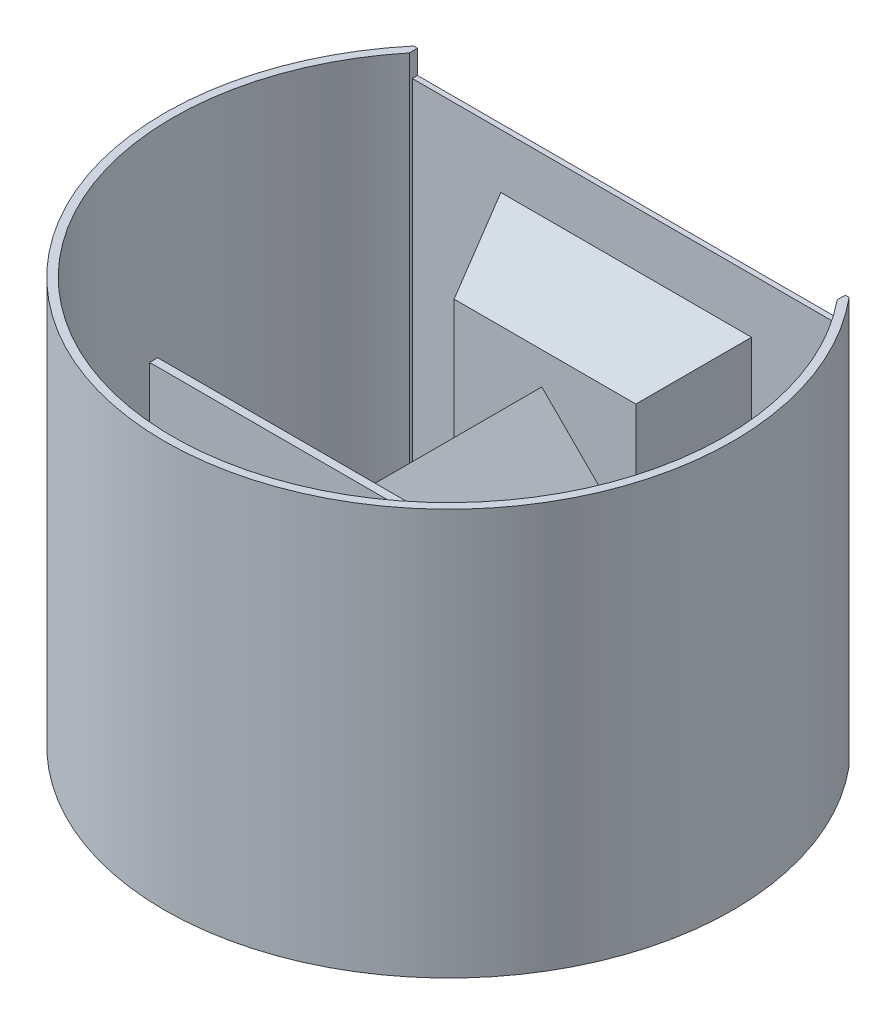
ISO-10303-21;
HEADER;
FILE_DESCRIPTION(('STEP AP214'),'2;1');
FILE_NAME('part.step','',(''),(''),'','','');
FILE_SCHEMA(('AUTOMOTIVE_DESIGN { 1 0 10303 214 1 1 1 1 }'));
ENDSEC;
DATA;
#1=APPLICATION_CONTEXT('core data for automotive mechanical design processes');
#2=APPLICATION_PROTOCOL_DEFINITION('international standard','automotive_design',2000,#1);
#3=PRODUCT_CONTEXT('',#1,'mechanical');
#4=PRODUCT('Part','Part','',(#3));
#5=PRODUCT_RELATED_PRODUCT_CATEGORY('part','',(#4));
#6=PRODUCT_DEFINITION_FORMATION('','',#4);
#7=PRODUCT_DEFINITION_CONTEXT('part definition',#1,'design');
#8=PRODUCT_DEFINITION('design','',#6,#7);
#9=PRODUCT_DEFINITION_SHAPE('','',#8);
#10=(LENGTH_UNIT() NAMED_UNIT(*) SI_UNIT(.MILLI.,.METRE.));
#11=(NAMED_UNIT(*) PLANE_ANGLE_UNIT() SI_UNIT($,.RADIAN.));
#12=(NAMED_UNIT(*) SI_UNIT($,.STERADIAN.) SOLID_ANGLE_UNIT());
#13=UNCERTAINTY_MEASURE_WITH_UNIT(LENGTH_MEASURE(1.E-05),#10,'distance_accuracy_value','');
#14=(GEOMETRIC_REPRESENTATION_CONTEXT(3) GLOBAL_UNCERTAINTY_ASSIGNED_CONTEXT((#13)) GLOBAL_UNIT_ASSIGNED_CONTEXT((#10,
#11,#12)) REPRESENTATION_CONTEXT('',''));
#15=CARTESIAN_POINT('',(0.,0.,0.));
#16=DIRECTION('',(0.,0.,1.));
#17=DIRECTION('',(1.,0.,0.));
#18=AXIS2_PLACEMENT_3D('',#15,#16,#17);
#19=CARTESIAN_POINT('',(0.,0.,-23.7173601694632));
#20=DIRECTION('',(0.,0.,-1.));
#21=DIRECTION('',(-1.,0.,0.));
#22=AXIS2_PLACEMENT_3D('',#19,#20,#21);
#23=PLANE('',#22);
#24=DIRECTION('',(0.,-1.,0.));
#25=VECTOR('',#24,1.);
#26=CARTESIAN_POINT('',(22.3824970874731,0.,-23.7173601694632));
#27=LINE('',#26,#25);
#28=CARTESIAN_POINT('',(22.3824970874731,27.7231903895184,-23.7173601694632));
#29=VERTEX_POINT('',#28);
#30=CARTESIAN_POINT('',(22.3824970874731,72.2768096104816,-23.7173601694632));
#31=VERTEX_POINT('',#30);
#32=EDGE_CURVE('E280',#29,#31,#27,.F.);
#33=ORIENTED_EDGE('',*,*,#32,.T.);
#34=DIRECTION('',(1.,0.,0.));
#35=VECTOR('',#34,1.);
#36=CARTESIAN_POINT('',(0.,72.2768096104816,-23.7173601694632));
#37=LINE('',#36,#35);
#38=CARTESIAN_POINT('',(-22.3824970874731,72.2768096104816,-23.7173601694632));
#39=VERTEX_POINT('',#38);
#40=EDGE_CURVE('E302',#31,#39,#37,.F.);
#41=ORIENTED_EDGE('',*,*,#40,.T.);
#42=DIRECTION('',(0.,1.,0.));
#43=VECTOR('',#42,1.);
#44=CARTESIAN_POINT('',(-22.3824970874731,0.,-23.7173601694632));
#45=LINE('',#44,#43);
#46=CARTESIAN_POINT('',(-22.3824970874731,27.7231903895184,-23.7173601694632));
#47=VERTEX_POINT('',#46);
#48=EDGE_CURVE('E305',#39,#47,#45,.F.);
#49=ORIENTED_EDGE('',*,*,#48,.T.);
#50=DIRECTION('',(-1.,0.,0.));
#51=VECTOR('',#50,1.);
#52=CARTESIAN_POINT('',(0.,27.7231903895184,-23.7173601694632));
#53=LINE('',#52,#51);
#54=EDGE_CURVE('E292',#47,#29,#53,.F.);
#55=ORIENTED_EDGE('',*,*,#54,.T.);
#56=EDGE_LOOP('',(#33,#41,#49,#55));
#57=FACE_BOUND('',#56,.T.);
#58=DIRECTION('',(0.707106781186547,-0.707106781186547,0.));
#59=VECTOR('',#58,1.);
#60=CARTESIAN_POINT('',(-0.784877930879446,34.3357580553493,-23.7173601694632));
#61=LINE('',#60,#59);
#62=CARTESIAN_POINT('',(-15.7848779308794,49.3357580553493,-23.7173601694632));
#63=VERTEX_POINT('',#62);
#64=CARTESIAN_POINT('',(-0.784877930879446,34.3357580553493,-23.7173601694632));
#65=VERTEX_POINT('',#64);
#66=EDGE_CURVE('E55',#63,#65,#61,.T.);
#67=ORIENTED_EDGE('',*,*,#66,.F.);
#68=DIRECTION('',(-0.707106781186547,-0.707106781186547,0.));
#69=VECTOR('',#68,1.);
#70=CARTESIAN_POINT('',(-15.7848779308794,49.3357580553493,-23.7173601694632));
#71=LINE('',#70,#69);
#72=CARTESIAN_POINT('',(-0.784877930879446,64.3357580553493,-23.7173601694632));
#73=VERTEX_POINT('',#72);
#74=EDGE_CURVE('E59',#73,#63,#71,.T.);
#75=ORIENTED_EDGE('',*,*,#74,.F.);
#76=DIRECTION('',(-0.707106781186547,0.707106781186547,0.));
#77=VECTOR('',#76,1.);
#78=CARTESIAN_POINT('',(-0.784877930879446,64.3357580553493,-23.7173601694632));
#79=LINE('',#78,#77);
#80=CARTESIAN_POINT('',(14.2151220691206,49.3357580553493,-23.7173601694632));
#81=VERTEX_POINT('',#80);
#82=EDGE_CURVE('E244',#81,#73,#79,.T.);
#83=ORIENTED_EDGE('',*,*,#82,.F.);
#84=DIRECTION('',(0.707106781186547,0.707106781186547,0.));
#85=VECTOR('',#84,1.);
#86=CARTESIAN_POINT('',(14.2151220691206,49.3357580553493,-23.7173601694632));
#87=LINE('',#86,#85);
#88=EDGE_CURVE('E218',#65,#81,#87,.T.);
#89=ORIENTED_EDGE('',*,*,#88,.F.);
#90=EDGE_LOOP('',(#67,#75,#83,#89));
#91=FACE_BOUND('',#90,.T.);
#92=ADVANCED_FACE('F39',(#57,#91),#23,.F.);
#93=CARTESIAN_POINT('',(53.3217312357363,5.81355426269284,-43.7173601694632));
#94=DIRECTION('',(0.,0.,-1.));
#95=DIRECTION('',(-1.,0.,0.));
#96=AXIS2_PLACEMENT_3D('',#93,#94,#95);
#97=PLANE('',#96);
#98=DIRECTION('',(-1.,0.,0.));
#99=VECTOR('',#98,1.);
#100=CARTESIAN_POINT('',(53.3217312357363,5.81355426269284,-43.7173601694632));
#101=LINE('',#100,#99);
#102=CARTESIAN_POINT('',(52.6782687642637,5.81355426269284,-43.7173601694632));
#103=VERTEX_POINT('',#102);
#104=CARTESIAN_POINT('',(-52.6782687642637,5.81355426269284,-43.7173601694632));
#105=VERTEX_POINT('',#104);
#106=EDGE_CURVE('E330',#103,#105,#101,.T.);
#107=ORIENTED_EDGE('',*,*,#106,.F.);
#108=DIRECTION('',(0.,1.,0.));
#109=VECTOR('',#108,1.);
#110=CARTESIAN_POINT('',(52.6782687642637,100.,-43.7173601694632));
#111=LINE('',#110,#109);
#112=CARTESIAN_POINT('',(52.6782687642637,94.1864457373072,-43.7173601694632));
#113=VERTEX_POINT('',#112);
#114=EDGE_CURVE('E48',#103,#113,#111,.T.);
#115=ORIENTED_EDGE('',*,*,#114,.T.);
#116=DIRECTION('',(-1.,0.,0.));
#117=VECTOR('',#116,1.);
#118=CARTESIAN_POINT('',(53.3217312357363,94.1864457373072,-43.7173601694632));
#119=LINE('',#118,#117);
#120=CARTESIAN_POINT('',(-52.6782687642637,94.1864457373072,-43.7173601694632));
#121=VERTEX_POINT('',#120);
#122=EDGE_CURVE('E320',#113,#121,#119,.T.);
#123=ORIENTED_EDGE('',*,*,#122,.T.);
#124=DIRECTION('',(0.,-1.,0.));
#125=VECTOR('',#124,1.);
#126=CARTESIAN_POINT('',(-52.6782687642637,5.81355426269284,-43.7173601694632));
#127=LINE('',#126,#125);
#128=EDGE_CURVE('E285',#121,#105,#127,.T.);
#129=ORIENTED_EDGE('',*,*,#128,.T.);
#130=EDGE_LOOP('',(#107,#115,#123,#129));
#131=FACE_BOUND('',#130,.T.);
#132=DIRECTION('',(0.,1.,0.));
#133=VECTOR('',#132,1.);
#134=CARTESIAN_POINT('',(30.8719934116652,19.2336940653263,-43.7173601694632));
#135=LINE('',#134,#133);
#136=CARTESIAN_POINT('',(30.8719934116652,19.2336940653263,-43.7173601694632));
#137=VERTEX_POINT('',#136);
#138=CARTESIAN_POINT('',(30.8719934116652,80.7663059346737,-43.7173601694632));
#139=VERTEX_POINT('',#138);
#140=EDGE_CURVE('E264',#137,#139,#135,.T.);
#141=ORIENTED_EDGE('',*,*,#140,.F.);
#142=DIRECTION('',(1.,0.,0.));
#143=VECTOR('',#142,1.);
#144=CARTESIAN_POINT('',(-30.8719934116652,19.2336940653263,-43.7173601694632));
#145=LINE('',#144,#143);
#146=CARTESIAN_POINT('',(-30.8719934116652,19.2336940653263,-43.7173601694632));
#147=VERTEX_POINT('',#146);
#148=EDGE_CURVE('E276',#147,#137,#145,.T.);
#149=ORIENTED_EDGE('',*,*,#148,.F.);
#150=DIRECTION('',(0.,-1.,0.));
#151=VECTOR('',#150,1.);
#152=CARTESIAN_POINT('',(-30.8719934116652,19.2336940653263,-43.7173601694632));
#153=LINE('',#152,#151);
#154=CARTESIAN_POINT('',(-30.8719934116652,80.7663059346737,-43.7173601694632));
#155=VERTEX_POINT('',#154);
#156=EDGE_CURVE('E272',#155,#147,#153,.T.);
#157=ORIENTED_EDGE('',*,*,#156,.F.);
#158=DIRECTION('',(-1.,0.,0.));
#159=VECTOR('',#158,1.);
#160=CARTESIAN_POINT('',(-30.8719934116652,80.7663059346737,-43.7173601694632));
#161=LINE('',#160,#159);
#162=EDGE_CURVE('E268',#139,#155,#161,.T.);
#163=ORIENTED_EDGE('',*,*,#162,.F.);
#164=EDGE_LOOP('',(#141,#149,#157,#163));
#165=FACE_BOUND('',#164,.T.);
#166=ADVANCED_FACE('F406',(#131,#165),#97,.F.);
#167=CARTESIAN_POINT('',(-52.6782687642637,100.,-43.));
#168=DIRECTION('',(-1.,0.,0.));
#169=DIRECTION('',(0.,0.,1.));
#170=AXIS2_PLACEMENT_3D('',#167,#168,#169);
#171=PLANE('',#170);
#172=DIRECTION('',(0.,0.,-1.));
#173=VECTOR('',#172,1.);
#174=CARTESIAN_POINT('',(-52.6782687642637,5.81355426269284,-43.7173601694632));
#175=LINE('',#174,#173);
#176=CARTESIAN_POINT('',(-52.6782687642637,5.81355426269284,-45.));
#177=VERTEX_POINT('',#176);
#178=EDGE_CURVE('E313',#105,#177,#175,.T.);
#179=ORIENTED_EDGE('',*,*,#178,.F.);
#180=ORIENTED_EDGE('',*,*,#128,.F.);
#181=DIRECTION('',(0.,0.,1.));
#182=VECTOR('',#181,1.);
#183=CARTESIAN_POINT('',(-52.6782687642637,94.1864457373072,-43.7173601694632));
#184=LINE('',#183,#182);
#185=CARTESIAN_POINT('',(-52.6782687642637,94.1864457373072,-45.));
#186=VERTEX_POINT('',#185);
#187=EDGE_CURVE('E316',#186,#121,#184,.T.);
#188=ORIENTED_EDGE('',*,*,#187,.F.);
#189=DIRECTION('',(0.,-1.,0.));
#190=VECTOR('',#189,1.);
#191=CARTESIAN_POINT('',(-52.6782687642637,100.,-45.));
#192=LINE('',#191,#190);
#193=CARTESIAN_POINT('',(-52.6782687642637,100.,-45.));
#194=VERTEX_POINT('',#193);
#195=EDGE_CURVE('E390',#194,#186,#192,.T.);
#196=ORIENTED_EDGE('',*,*,#195,.F.);
#197=DIRECTION('',(0.,0.,-1.));
#198=VECTOR('',#197,1.);
#199=CARTESIAN_POINT('',(-52.6782687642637,100.,-43.));
#200=LINE('',#199,#198);
#201=CARTESIAN_POINT('',(-52.6782687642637,100.,-43.));
#202=VERTEX_POINT('',#201);
#203=EDGE_CURVE('E338',#202,#194,#200,.T.);
#204=ORIENTED_EDGE('',*,*,#203,.F.);
#205=DIRECTION('',(0.,-1.,0.));
#206=VECTOR('',#205,1.);
#207=CARTESIAN_POINT('',(-52.6782687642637,100.,-43.));
#208=LINE('',#207,#206);
#209=CARTESIAN_POINT('',(-52.6782687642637,0.,-43.));
#210=VERTEX_POINT('',#209);
#211=EDGE_CURVE('E394',#202,#210,#208,.T.);
#212=ORIENTED_EDGE('',*,*,#211,.T.);
#213=DIRECTION('',(0.,0.,-1.));
#214=VECTOR('',#213,1.);
#215=CARTESIAN_POINT('',(-52.6782687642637,0.,-43.));
#216=LINE('',#215,#214);
#217=CARTESIAN_POINT('',(-52.6782687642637,0.,-45.));
#218=VERTEX_POINT('',#217);
#219=EDGE_CURVE('E358',#210,#218,#216,.T.);
#220=ORIENTED_EDGE('',*,*,#219,.T.);
#221=EDGE_CURVE('E389',#177,#218,#192,.T.);
#222=ORIENTED_EDGE('',*,*,#221,.F.);
#223=EDGE_LOOP('',(#179,#180,#188,#196,#204,#212,#220,#222));
#224=FACE_BOUND('',#223,.T.);
#225=ADVANCED_FACE('F417',(#224),#171,.F.);
#226=CARTESIAN_POINT('',(52.6782687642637,100.,-43.));
#227=DIRECTION('',(1.,0.,0.));
#228=DIRECTION('',(0.,0.,-1.));
#229=AXIS2_PLACEMENT_3D('',#226,#227,#228);
#230=PLANE('',#229);
#231=DIRECTION('',(0.,0.,1.));
#232=VECTOR('',#231,1.);
#233=CARTESIAN_POINT('',(52.6782687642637,5.81355426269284,-43.));
#234=LINE('',#233,#232);
#235=CARTESIAN_POINT('',(52.6782687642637,5.81355426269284,-45.));
#236=VERTEX_POINT('',#235);
#237=EDGE_CURVE('E11',#236,#103,#234,.T.);
#238=ORIENTED_EDGE('',*,*,#237,.F.);
#239=DIRECTION('',(0.,-1.,0.));
#240=VECTOR('',#239,1.);
#241=CARTESIAN_POINT('',(52.6782687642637,100.,-45.));
#242=LINE('',#241,#240);
#243=CARTESIAN_POINT('',(52.6782687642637,0.,-45.));
#244=VERTEX_POINT('',#243);
#245=EDGE_CURVE('E377',#236,#244,#242,.T.);
#246=ORIENTED_EDGE('',*,*,#245,.T.);
#247=DIRECTION('',(0.,0.,1.));
#248=VECTOR('',#247,1.);
#249=CARTESIAN_POINT('',(52.6782687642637,0.,-43.));
#250=LINE('',#249,#248);
#251=CARTESIAN_POINT('',(52.6782687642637,0.,-43.));
#252=VERTEX_POINT('',#251);
#253=EDGE_CURVE('E339',#244,#252,#250,.T.);
#254=ORIENTED_EDGE('',*,*,#253,.T.);
#255=DIRECTION('',(0.,-1.,0.));
#256=VECTOR('',#255,1.);
#257=CARTESIAN_POINT('',(52.6782687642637,100.,-43.));
#258=LINE('',#257,#256);
#259=CARTESIAN_POINT('',(52.6782687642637,100.,-43.));
#260=VERTEX_POINT('',#259);
#261=EDGE_CURVE('E354',#260,#252,#258,.T.);
#262=ORIENTED_EDGE('',*,*,#261,.F.);
#263=DIRECTION('',(0.,0.,1.));
#264=VECTOR('',#263,1.);
#265=CARTESIAN_POINT('',(52.6782687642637,100.,-43.));
#266=LINE('',#265,#264);
#267=CARTESIAN_POINT('',(52.6782687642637,100.,-45.));
#268=VERTEX_POINT('',#267);
#269=EDGE_CURVE('E351',#268,#260,#266,.T.);
#270=ORIENTED_EDGE('',*,*,#269,.F.);
#271=CARTESIAN_POINT('',(52.6782687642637,94.1864457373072,-45.));
#272=VERTEX_POINT('',#271);
#273=EDGE_CURVE('E378',#268,#272,#242,.T.);
#274=ORIENTED_EDGE('',*,*,#273,.T.);
#275=DIRECTION('',(0.,0.,-1.));
#276=VECTOR('',#275,1.);
#277=CARTESIAN_POINT('',(52.6782687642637,94.1864457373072,-43.));
#278=LINE('',#277,#276);
#279=EDGE_CURVE('E398',#113,#272,#278,.T.);
#280=ORIENTED_EDGE('',*,*,#279,.F.);
#281=ORIENTED_EDGE('',*,*,#114,.F.);
#282=EDGE_LOOP('',(#238,#246,#254,#262,#270,#274,#280,#281));
#283=FACE_BOUND('',#282,.T.);
#284=ADVANCED_FACE('F429',(#283),#230,.F.);
#285=CARTESIAN_POINT('',(0.,100.,0.));
#286=DIRECTION('',(0.,-1.,0.));
#287=DIRECTION('',(0.,0.,-1.));
#288=AXIS2_PLACEMENT_3D('',#285,#286,#287);
#289=CYLINDRICAL_SURFACE('',#288,68.);
#290=CARTESIAN_POINT('',(0.,0.,0.));
#291=DIRECTION('',(0.,-1.,0.));
#292=DIRECTION('',(0.,0.,1.));
#293=AXIS2_PLACEMENT_3D('',#290,#291,#292);
#294=CIRCLE('',#293,68.);
#295=EDGE_CURVE('E333',#252,#210,#294,.T.);
#296=ORIENTED_EDGE('',*,*,#295,.T.);
#297=ORIENTED_EDGE('',*,*,#211,.F.);
#298=CARTESIAN_POINT('',(0.,100.,0.));
#299=DIRECTION('',(0.,-1.,0.));
#300=DIRECTION('',(0.,0.,1.));
#301=AXIS2_PLACEMENT_3D('',#298,#299,#300);
#302=CIRCLE('',#301,68.);
#303=EDGE_CURVE('E334',#260,#202,#302,.T.);
#304=ORIENTED_EDGE('',*,*,#303,.F.);
#305=ORIENTED_EDGE('',*,*,#261,.T.);
#306=EDGE_LOOP('',(#296,#297,#304,#305));
#307=FACE_BOUND('',#306,.T.);
#308=ADVANCED_FACE('F41',(#307),#289,.F.);
#309=CARTESIAN_POINT('',(0.,100.,0.));
#310=DIRECTION('',(0.,-1.,0.));
#311=DIRECTION('',(0.,0.,-1.));
#312=AXIS2_PLACEMENT_3D('',#309,#310,#311);
#313=CYLINDRICAL_SURFACE('',#312,70.);
#314=CARTESIAN_POINT('',(0.,0.,0.));
#315=DIRECTION('',(0.,1.,0.));
#316=DIRECTION('',(0.,0.,1.));
#317=AXIS2_PLACEMENT_3D('',#314,#315,#316);
#318=CIRCLE('',#317,70.);
#319=CARTESIAN_POINT('',(-53.619026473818,0.,-45.));
#320=VERTEX_POINT('',#319);
#321=CARTESIAN_POINT('',(53.6190264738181,0.,-45.));
#322=VERTEX_POINT('',#321);
#323=EDGE_CURVE('E365',#320,#322,#318,.T.);
#324=ORIENTED_EDGE('',*,*,#323,.T.);
#325=DIRECTION('',(0.,-1.,0.));
#326=VECTOR('',#325,1.);
#327=CARTESIAN_POINT('',(53.6190264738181,100.,-45.));
#328=LINE('',#327,#326);
#329=CARTESIAN_POINT('',(53.6190264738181,100.,-45.));
#330=VERTEX_POINT('',#329);
#331=EDGE_CURVE('E381',#330,#322,#328,.T.);
#332=ORIENTED_EDGE('',*,*,#331,.F.);
#333=CARTESIAN_POINT('',(0.,100.,0.));
#334=DIRECTION('',(0.,1.,0.));
#335=DIRECTION('',(0.,0.,1.));
#336=AXIS2_PLACEMENT_3D('',#333,#334,#335);
#337=CIRCLE('',#336,70.);
#338=CARTESIAN_POINT('',(-53.619026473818,100.,-45.));
#339=VERTEX_POINT('',#338);
#340=EDGE_CURVE('E345',#339,#330,#337,.T.);
#341=ORIENTED_EDGE('',*,*,#340,.F.);
#342=DIRECTION('',(0.,-1.,0.));
#343=VECTOR('',#342,1.);
#344=CARTESIAN_POINT('',(-53.619026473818,100.,-45.));
#345=LINE('',#344,#343);
#346=EDGE_CURVE('E385',#339,#320,#345,.T.);
#347=ORIENTED_EDGE('',*,*,#346,.T.);
#348=EDGE_LOOP('',(#324,#332,#341,#347));
#349=FACE_BOUND('',#348,.T.);
#350=ADVANCED_FACE('F449',(#349),#313,.T.);
#351=CARTESIAN_POINT('',(52.6782687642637,100.,-45.));
#352=DIRECTION('',(0.,0.,1.));
#353=DIRECTION('',(1.,0.,0.));
#354=AXIS2_PLACEMENT_3D('',#351,#352,#353);
#355=PLANE('',#354);
#356=ORIENTED_EDGE('',*,*,#245,.F.);
#357=DIRECTION('',(-1.,0.,0.));
#358=VECTOR('',#357,1.);
#359=CARTESIAN_POINT('',(53.3217312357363,5.81355426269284,-45.));
#360=LINE('',#359,#358);
#361=EDGE_CURVE('E326',#236,#177,#360,.T.);
#362=ORIENTED_EDGE('',*,*,#361,.T.);
#363=ORIENTED_EDGE('',*,*,#221,.T.);
#364=DIRECTION('',(-1.,0.,0.));
#365=VECTOR('',#364,1.);
#366=CARTESIAN_POINT('',(-53.619026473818,0.,-45.));
#367=LINE('',#366,#365);
#368=EDGE_CURVE('E362',#218,#320,#367,.T.);
#369=ORIENTED_EDGE('',*,*,#368,.T.);
#370=ORIENTED_EDGE('',*,*,#346,.F.);
#371=DIRECTION('',(-1.,0.,0.));
#372=VECTOR('',#371,1.);
#373=CARTESIAN_POINT('',(-53.619026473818,100.,-45.));
#374=LINE('',#373,#372);
#375=EDGE_CURVE('E342',#194,#339,#374,.T.);
#376=ORIENTED_EDGE('',*,*,#375,.F.);
#377=ORIENTED_EDGE('',*,*,#195,.T.);
#378=DIRECTION('',(-1.,0.,0.));
#379=VECTOR('',#378,1.);
#380=CARTESIAN_POINT('',(53.3217312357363,94.1864457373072,-45.));
#381=LINE('',#380,#379);
#382=EDGE_CURVE('E323',#272,#186,#381,.T.);
#383=ORIENTED_EDGE('',*,*,#382,.F.);
#384=ORIENTED_EDGE('',*,*,#273,.F.);
#385=DIRECTION('',(-1.,0.,0.));
#386=VECTOR('',#385,1.);
#387=CARTESIAN_POINT('',(52.6782687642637,100.,-45.));
#388=LINE('',#387,#386);
#389=EDGE_CURVE('E348',#330,#268,#388,.T.);
#390=ORIENTED_EDGE('',*,*,#389,.F.);
#391=ORIENTED_EDGE('',*,*,#331,.T.);
#392=DIRECTION('',(-1.,0.,0.));
#393=VECTOR('',#392,1.);
#394=CARTESIAN_POINT('',(52.6782687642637,0.,-45.));
#395=LINE('',#394,#393);
#396=EDGE_CURVE('E368',#322,#244,#395,.T.);
#397=ORIENTED_EDGE('',*,*,#396,.T.);
#398=EDGE_LOOP('',(#356,#362,#363,#369,#370,#376,#377,#383,#384,#390,#391,#397));
#399=FACE_BOUND('',#398,.T.);
#400=ADVANCED_FACE('F424',(#399),#355,.F.);
#401=CARTESIAN_POINT('',(0.,100.,0.));
#402=DIRECTION('',(0.,1.,0.));
#403=DIRECTION('',(0.,0.,1.));
#404=AXIS2_PLACEMENT_3D('',#401,#402,#403);
#405=PLANE('',#404);
#406=ORIENTED_EDGE('',*,*,#303,.T.);
#407=ORIENTED_EDGE('',*,*,#203,.T.);
#408=ORIENTED_EDGE('',*,*,#375,.T.);
#409=ORIENTED_EDGE('',*,*,#340,.T.);
#410=ORIENTED_EDGE('',*,*,#389,.T.);
#411=ORIENTED_EDGE('',*,*,#269,.T.);
#412=EDGE_LOOP('',(#406,#407,#408,#409,#410,#411));
#413=FACE_BOUND('',#412,.T.);
#414=ADVANCED_FACE('F442',(#413),#405,.T.);
#415=CARTESIAN_POINT('',(0.,0.,0.));
#416=DIRECTION('',(0.,1.,0.));
#417=DIRECTION('',(0.,0.,1.));
#418=AXIS2_PLACEMENT_3D('',#415,#416,#417);
#419=PLANE('',#418);
#420=ORIENTED_EDGE('',*,*,#295,.F.);
#421=ORIENTED_EDGE('',*,*,#253,.F.);
#422=ORIENTED_EDGE('',*,*,#396,.F.);
#423=ORIENTED_EDGE('',*,*,#323,.F.);
#424=ORIENTED_EDGE('',*,*,#368,.F.);
#425=ORIENTED_EDGE('',*,*,#219,.F.);
#426=EDGE_LOOP('',(#420,#421,#422,#423,#424,#425));
#427=FACE_BOUND('',#426,.T.);
#428=ADVANCED_FACE('F437',(#427),#419,.F.);
#429=CARTESIAN_POINT('',(53.3217312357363,5.81355426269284,-43.7173601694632));
#430=DIRECTION('',(0.,1.,0.));
#431=DIRECTION('',(0.,0.,1.));
#432=AXIS2_PLACEMENT_3D('',#429,#430,#431);
#433=PLANE('',#432);
#434=ORIENTED_EDGE('',*,*,#361,.F.);
#435=ORIENTED_EDGE('',*,*,#237,.T.);
#436=ORIENTED_EDGE('',*,*,#106,.T.);
#437=ORIENTED_EDGE('',*,*,#178,.T.);
#438=EDGE_LOOP('',(#434,#435,#436,#437));
#439=FACE_BOUND('',#438,.T.);
#440=ADVANCED_FACE('F421',(#439),#433,.F.);
#441=CARTESIAN_POINT('',(53.3217312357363,94.1864457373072,-43.7173601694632));
#442=DIRECTION('',(0.,-1.,0.));
#443=DIRECTION('',(0.,0.,-1.));
#444=AXIS2_PLACEMENT_3D('',#441,#442,#443);
#445=PLANE('',#444);
#446=ORIENTED_EDGE('',*,*,#122,.F.);
#447=ORIENTED_EDGE('',*,*,#279,.T.);
#448=ORIENTED_EDGE('',*,*,#382,.T.);
#449=ORIENTED_EDGE('',*,*,#187,.T.);
#450=EDGE_LOOP('',(#446,#447,#448,#449));
#451=FACE_BOUND('',#450,.T.);
#452=ADVANCED_FACE('F410',(#451),#445,.F.);
#453=CARTESIAN_POINT('',(30.8719934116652,19.2336940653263,-43.7173601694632));
#454=DIRECTION('',(0.92050485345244,0.,0.390731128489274));
#455=DIRECTION('',(0.390731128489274,0.,-0.92050485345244));
#456=AXIS2_PLACEMENT_3D('',#453,#454,#455);
#457=PLANE('',#456);
#458=ORIENTED_EDGE('',*,*,#140,.T.);
#459=DIRECTION('',(0.363936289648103,0.363936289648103,-0.857380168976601));
#460=VECTOR('',#459,1.);
#461=CARTESIAN_POINT('',(22.6940256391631,72.5883381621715,-24.4512754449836));
#462=LINE('',#461,#460);
#463=EDGE_CURVE('E281',#31,#139,#462,.T.);
#464=ORIENTED_EDGE('',*,*,#463,.F.);
#465=ORIENTED_EDGE('',*,*,#32,.F.);
#466=DIRECTION('',(0.363936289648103,-0.363936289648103,-0.857380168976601));
#467=VECTOR('',#466,1.);
#468=CARTESIAN_POINT('',(30.8719934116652,19.2336940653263,-43.7173601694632));
#469=LINE('',#468,#467);
#470=EDGE_CURVE('E287',#29,#137,#469,.T.);
#471=ORIENTED_EDGE('',*,*,#470,.T.);
#472=EDGE_LOOP('',(#458,#464,#465,#471));
#473=FACE_BOUND('',#472,.T.);
#474=ADVANCED_FACE('F468',(#473),#457,.T.);
#475=CARTESIAN_POINT('',(-30.8719934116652,80.7663059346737,-43.7173601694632));
#476=DIRECTION('',(0.,0.92050485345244,0.390731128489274));
#477=DIRECTION('',(0.,-0.390731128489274,0.92050485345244));
#478=AXIS2_PLACEMENT_3D('',#475,#476,#477);
#479=PLANE('',#478);
#480=ORIENTED_EDGE('',*,*,#162,.T.);
#481=DIRECTION('',(-0.363936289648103,0.363936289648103,-0.857380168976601));
#482=VECTOR('',#481,1.);
#483=CARTESIAN_POINT('',(-22.7220221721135,72.6163346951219,-24.5172311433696));
#484=LINE('',#483,#482);
#485=EDGE_CURVE('E286',#39,#155,#484,.T.);
#486=ORIENTED_EDGE('',*,*,#485,.F.);
#487=ORIENTED_EDGE('',*,*,#40,.F.);
#488=ORIENTED_EDGE('',*,*,#463,.T.);
#489=EDGE_LOOP('',(#480,#486,#487,#488));
#490=FACE_BOUND('',#489,.T.);
#491=ADVANCED_FACE('F471',(#490),#479,.T.);
#492=CARTESIAN_POINT('',(-30.8719934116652,19.2336940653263,-43.7173601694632));
#493=DIRECTION('',(-0.92050485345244,0.,0.390731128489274));
#494=DIRECTION('',(0.390731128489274,0.,0.92050485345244));
#495=AXIS2_PLACEMENT_3D('',#492,#493,#494);
#496=PLANE('',#495);
#497=ORIENTED_EDGE('',*,*,#156,.T.);
#498=DIRECTION('',(-0.363936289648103,-0.363936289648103,-0.857380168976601));
#499=VECTOR('',#498,1.);
#500=CARTESIAN_POINT('',(-30.8719934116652,19.2336940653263,-43.7173601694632));
#501=LINE('',#500,#499);
#502=EDGE_CURVE('E291',#47,#147,#501,.T.);
#503=ORIENTED_EDGE('',*,*,#502,.F.);
#504=ORIENTED_EDGE('',*,*,#48,.F.);
#505=ORIENTED_EDGE('',*,*,#485,.T.);
#506=EDGE_LOOP('',(#497,#503,#504,#505));
#507=FACE_BOUND('',#506,.T.);
#508=ADVANCED_FACE('F476',(#507),#496,.T.);
#509=CARTESIAN_POINT('',(-30.8719934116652,19.2336940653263,-43.7173601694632));
#510=DIRECTION('',(0.,-0.92050485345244,0.390731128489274));
#511=DIRECTION('',(0.,-0.390731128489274,-0.92050485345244));
#512=AXIS2_PLACEMENT_3D('',#509,#510,#511);
#513=PLANE('',#512);
#514=ORIENTED_EDGE('',*,*,#148,.T.);
#515=ORIENTED_EDGE('',*,*,#470,.F.);
#516=ORIENTED_EDGE('',*,*,#54,.F.);
#517=ORIENTED_EDGE('',*,*,#502,.T.);
#518=EDGE_LOOP('',(#514,#515,#516,#517));
#519=FACE_BOUND('',#518,.T.);
#520=ADVANCED_FACE('F473',(#519),#513,.T.);
#521=CARTESIAN_POINT('',(-0.784877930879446,34.3357580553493,37.2826398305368));
#522=DIRECTION('',(0.707106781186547,0.707106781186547,0.));
#523=DIRECTION('',(-0.707106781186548,0.707106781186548,0.));
#524=AXIS2_PLACEMENT_3D('',#521,#522,#523);
#525=PLANE('',#524);
#526=ORIENTED_EDGE('',*,*,#66,.T.);
#527=DIRECTION('',(0.,0.,-1.));
#528=VECTOR('',#527,1.);
#529=CARTESIAN_POINT('',(-0.784877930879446,34.3357580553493,37.2826398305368));
#530=LINE('',#529,#528);
#531=CARTESIAN_POINT('',(-0.784877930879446,34.3357580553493,37.2826398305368));
#532=VERTEX_POINT('',#531);
#533=EDGE_CURVE('E260',#532,#65,#530,.T.);
#534=ORIENTED_EDGE('',*,*,#533,.F.);
#535=DIRECTION('',(0.707106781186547,-0.707106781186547,0.));
#536=VECTOR('',#535,1.);
#537=CARTESIAN_POINT('',(-0.784877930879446,34.3357580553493,37.2826398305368));
#538=LINE('',#537,#536);
#539=CARTESIAN_POINT('',(-15.7848779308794,49.3357580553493,37.2826398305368));
#540=VERTEX_POINT('',#539);
#541=EDGE_CURVE('E224',#540,#532,#538,.T.);
#542=ORIENTED_EDGE('',*,*,#541,.F.);
#543=DIRECTION('',(0.,0.,-1.));
#544=VECTOR('',#543,1.);
#545=CARTESIAN_POINT('',(-15.7848779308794,49.3357580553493,37.2826398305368));
#546=LINE('',#545,#544);
#547=EDGE_CURVE('E239',#540,#63,#546,.T.);
#548=ORIENTED_EDGE('',*,*,#547,.T.);
#549=EDGE_LOOP('',(#526,#534,#542,#548));
#550=FACE_BOUND('',#549,.T.);
#551=ADVANCED_FACE('F466',(#550),#525,.F.);
#552=CARTESIAN_POINT('',(14.2151220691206,49.3357580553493,37.2826398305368));
#553=DIRECTION('',(-0.707106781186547,0.707106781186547,0.));
#554=DIRECTION('',(-0.707106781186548,-0.707106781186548,0.));
#555=AXIS2_PLACEMENT_3D('',#552,#553,#554);
#556=PLANE('',#555);
#557=ORIENTED_EDGE('',*,*,#88,.T.);
#558=DIRECTION('',(0.,0.,-1.));
#559=VECTOR('',#558,1.);
#560=CARTESIAN_POINT('',(14.2151220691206,49.3357580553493,37.2826398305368));
#561=LINE('',#560,#559);
#562=CARTESIAN_POINT('',(14.2151220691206,49.3357580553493,37.2826398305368));
#563=VERTEX_POINT('',#562);
#564=EDGE_CURVE('E256',#563,#81,#561,.T.);
#565=ORIENTED_EDGE('',*,*,#564,.F.);
#566=DIRECTION('',(0.707106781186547,0.707106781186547,0.));
#567=VECTOR('',#566,1.);
#568=CARTESIAN_POINT('',(14.2151220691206,49.3357580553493,37.2826398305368));
#569=LINE('',#568,#567);
#570=EDGE_CURVE('E228',#532,#563,#569,.T.);
#571=ORIENTED_EDGE('',*,*,#570,.F.);
#572=ORIENTED_EDGE('',*,*,#533,.T.);
#573=EDGE_LOOP('',(#557,#565,#571,#572));
#574=FACE_BOUND('',#573,.T.);
#575=ADVANCED_FACE('F544',(#574),#556,.F.);
#576=CARTESIAN_POINT('',(-0.784877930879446,64.3357580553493,37.2826398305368));
#577=DIRECTION('',(-0.707106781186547,-0.707106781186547,0.));
#578=DIRECTION('',(0.707106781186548,-0.707106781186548,0.));
#579=AXIS2_PLACEMENT_3D('',#576,#577,#578);
#580=PLANE('',#579);
#581=ORIENTED_EDGE('',*,*,#82,.T.);
#582=DIRECTION('',(0.,0.,-1.));
#583=VECTOR('',#582,1.);
#584=CARTESIAN_POINT('',(-0.784877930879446,64.3357580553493,37.2826398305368));
#585=LINE('',#584,#583);
#586=CARTESIAN_POINT('',(-0.784877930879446,64.3357580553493,37.2826398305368));
#587=VERTEX_POINT('',#586);
#588=EDGE_CURVE('E252',#587,#73,#585,.T.);
#589=ORIENTED_EDGE('',*,*,#588,.F.);
#590=DIRECTION('',(-0.707106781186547,0.707106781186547,0.));
#591=VECTOR('',#590,1.);
#592=CARTESIAN_POINT('',(-0.784877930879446,64.3357580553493,37.2826398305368));
#593=LINE('',#592,#591);
#594=EDGE_CURVE('E232',#563,#587,#593,.T.);
#595=ORIENTED_EDGE('',*,*,#594,.F.);
#596=ORIENTED_EDGE('',*,*,#564,.T.);
#597=EDGE_LOOP('',(#581,#589,#595,#596));
#598=FACE_BOUND('',#597,.T.);
#599=ADVANCED_FACE('F553',(#598),#580,.F.);
#600=CARTESIAN_POINT('',(-15.7848779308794,49.3357580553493,37.2826398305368));
#601=DIRECTION('',(0.707106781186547,-0.707106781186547,0.));
#602=DIRECTION('',(0.707106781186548,0.707106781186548,0.));
#603=AXIS2_PLACEMENT_3D('',#600,#601,#602);
#604=PLANE('',#603);
#605=ORIENTED_EDGE('',*,*,#74,.T.);
#606=ORIENTED_EDGE('',*,*,#547,.F.);
#607=DIRECTION('',(-0.707106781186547,-0.707106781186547,0.));
#608=VECTOR('',#607,1.);
#609=CARTESIAN_POINT('',(-15.7848779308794,49.3357580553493,37.2826398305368));
#610=LINE('',#609,#608);
#611=EDGE_CURVE('E236',#587,#540,#610,.T.);
#612=ORIENTED_EDGE('',*,*,#611,.F.);
#613=ORIENTED_EDGE('',*,*,#588,.T.);
#614=EDGE_LOOP('',(#605,#606,#612,#613));
#615=FACE_BOUND('',#614,.T.);
#616=ADVANCED_FACE('F562',(#615),#604,.F.);
#617=CARTESIAN_POINT('',(0.,0.,37.2826398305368));
#618=DIRECTION('',(0.,0.,1.));
#619=DIRECTION('',(1.,0.,0.));
#620=AXIS2_PLACEMENT_3D('',#617,#618,#619);
#621=PLANE('',#620);
#622=DIRECTION('',(1.,0.,0.));
#623=VECTOR('',#622,1.);
#624=CARTESIAN_POINT('',(-34.3824970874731,15.7231903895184,37.2826398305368));
#625=LINE('',#624,#623);
#626=CARTESIAN_POINT('',(-34.3824970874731,15.7231903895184,37.2826398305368));
#627=VERTEX_POINT('',#626);
#628=CARTESIAN_POINT('',(34.3824970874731,15.7231903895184,37.2826398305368));
#629=VERTEX_POINT('',#628);
#630=EDGE_CURVE('E213',#627,#629,#625,.T.);
#631=ORIENTED_EDGE('',*,*,#630,.F.);
#632=DIRECTION('',(0.,-1.,0.));
#633=VECTOR('',#632,1.);
#634=CARTESIAN_POINT('',(-34.3824970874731,84.2768096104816,37.2826398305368));
#635=LINE('',#634,#633);
#636=CARTESIAN_POINT('',(-34.3824970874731,84.2768096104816,37.2826398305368));
#637=VERTEX_POINT('',#636);
#638=EDGE_CURVE('E209',#637,#627,#635,.T.);
#639=ORIENTED_EDGE('',*,*,#638,.F.);
#640=DIRECTION('',(-1.,0.,0.));
#641=VECTOR('',#640,1.);
#642=CARTESIAN_POINT('',(34.3824970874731,84.2768096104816,37.2826398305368));
#643=LINE('',#642,#641);
#644=CARTESIAN_POINT('',(34.3824970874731,84.2768096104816,37.2826398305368));
#645=VERTEX_POINT('',#644);
#646=EDGE_CURVE('E636',#645,#637,#643,.T.);
#647=ORIENTED_EDGE('',*,*,#646,.F.);
#648=DIRECTION('',(0.,1.,0.));
#649=VECTOR('',#648,1.);
#650=CARTESIAN_POINT('',(34.3824970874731,15.7231903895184,37.2826398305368));
#651=LINE('',#650,#649);
#652=EDGE_CURVE('E641',#629,#645,#651,.T.);
#653=ORIENTED_EDGE('',*,*,#652,.F.);
#654=EDGE_LOOP('',(#631,#639,#647,#653));
#655=FACE_BOUND('',#654,.T.);
#656=ORIENTED_EDGE('',*,*,#611,.T.);
#657=ORIENTED_EDGE('',*,*,#541,.T.);
#658=ORIENTED_EDGE('',*,*,#570,.T.);
#659=ORIENTED_EDGE('',*,*,#594,.T.);
#660=EDGE_LOOP('',(#656,#657,#658,#659));
#661=FACE_BOUND('',#660,.T.);
#662=ADVANCED_FACE('F572',(#655,#661),#621,.F.);
#663=CARTESIAN_POINT('',(-34.3824970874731,15.7231903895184,39.2826398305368));
#664=DIRECTION('',(0.,1.,0.));
#665=DIRECTION('',(0.,0.,1.));
#666=AXIS2_PLACEMENT_3D('',#663,#664,#665);
#667=PLANE('',#666);
#668=ORIENTED_EDGE('',*,*,#630,.T.);
#669=DIRECTION('',(0.,0.,-1.));
#670=VECTOR('',#669,1.);
#671=CARTESIAN_POINT('',(34.3824970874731,15.7231903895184,39.2826398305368));
#672=LINE('',#671,#670);
#673=CARTESIAN_POINT('',(34.3824970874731,15.7231903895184,39.2826398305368));
#674=VERTEX_POINT('',#673);
#675=EDGE_CURVE('E191',#674,#629,#672,.T.);
#676=ORIENTED_EDGE('',*,*,#675,.F.);
#677=DIRECTION('',(1.,0.,0.));
#678=VECTOR('',#677,1.);
#679=CARTESIAN_POINT('',(-34.3824970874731,15.7231903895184,39.2826398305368));
#680=LINE('',#679,#678);
#681=CARTESIAN_POINT('',(-34.3824970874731,15.7231903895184,39.2826398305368));
#682=VERTEX_POINT('',#681);
#683=EDGE_CURVE('E199',#682,#674,#680,.T.);
#684=ORIENTED_EDGE('',*,*,#683,.F.);
#685=DIRECTION('',(0.,0.,-1.));
#686=VECTOR('',#685,1.);
#687=CARTESIAN_POINT('',(-34.3824970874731,15.7231903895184,39.2826398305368));
#688=LINE('',#687,#686);
#689=EDGE_CURVE('E632',#682,#627,#688,.T.);
#690=ORIENTED_EDGE('',*,*,#689,.T.);
#691=EDGE_LOOP('',(#668,#676,#684,#690));
#692=FACE_BOUND('',#691,.T.);
#693=ADVANCED_FACE('F211',(#692),#667,.F.);
#694=CARTESIAN_POINT('',(34.3824970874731,15.7231903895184,39.2826398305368));
#695=DIRECTION('',(-1.,0.,0.));
#696=DIRECTION('',(0.,0.,1.));
#697=AXIS2_PLACEMENT_3D('',#694,#695,#696);
#698=PLANE('',#697);
#699=ORIENTED_EDGE('',*,*,#652,.T.);
#700=DIRECTION('',(0.,0.,-1.));
#701=VECTOR('',#700,1.);
#702=CARTESIAN_POINT('',(34.3824970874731,84.2768096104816,39.2826398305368));
#703=LINE('',#702,#701);
#704=CARTESIAN_POINT('',(34.3824970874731,84.2768096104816,39.2826398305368));
#705=VERTEX_POINT('',#704);
#706=EDGE_CURVE('E194',#705,#645,#703,.T.);
#707=ORIENTED_EDGE('',*,*,#706,.F.);
#708=DIRECTION('',(0.,1.,0.));
#709=VECTOR('',#708,1.);
#710=CARTESIAN_POINT('',(34.3824970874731,15.7231903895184,39.2826398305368));
#711=LINE('',#710,#709);
#712=EDGE_CURVE('E187',#674,#705,#711,.T.);
#713=ORIENTED_EDGE('',*,*,#712,.F.);
#714=ORIENTED_EDGE('',*,*,#675,.T.);
#715=EDGE_LOOP('',(#699,#707,#713,#714));
#716=FACE_BOUND('',#715,.T.);
#717=ADVANCED_FACE('F189',(#716),#698,.F.);
#718=CARTESIAN_POINT('',(34.3824970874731,84.2768096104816,39.2826398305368));
#719=DIRECTION('',(0.,-1.,0.));
#720=DIRECTION('',(0.,0.,-1.));
#721=AXIS2_PLACEMENT_3D('',#718,#719,#720);
#722=PLANE('',#721);
#723=ORIENTED_EDGE('',*,*,#646,.T.);
#724=DIRECTION('',(0.,0.,-1.));
#725=VECTOR('',#724,1.);
#726=CARTESIAN_POINT('',(-34.3824970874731,84.2768096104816,39.2826398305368));
#727=LINE('',#726,#725);
#728=CARTESIAN_POINT('',(-34.3824970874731,84.2768096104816,39.2826398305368));
#729=VERTEX_POINT('',#728);
#730=EDGE_CURVE('E220',#729,#637,#727,.T.);
#731=ORIENTED_EDGE('',*,*,#730,.F.);
#732=DIRECTION('',(-1.,0.,0.));
#733=VECTOR('',#732,1.);
#734=CARTESIAN_POINT('',(34.3824970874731,84.2768096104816,39.2826398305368));
#735=LINE('',#734,#733);
#736=EDGE_CURVE('E198',#705,#729,#735,.T.);
#737=ORIENTED_EDGE('',*,*,#736,.F.);
#738=ORIENTED_EDGE('',*,*,#706,.T.);
#739=EDGE_LOOP('',(#723,#731,#737,#738));
#740=FACE_BOUND('',#739,.T.);
#741=ADVANCED_FACE('F599',(#740),#722,.F.);
#742=CARTESIAN_POINT('',(-34.3824970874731,84.2768096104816,39.2826398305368));
#743=DIRECTION('',(1.,0.,0.));
#744=DIRECTION('',(0.,0.,-1.));
#745=AXIS2_PLACEMENT_3D('',#742,#743,#744);
#746=PLANE('',#745);
#747=ORIENTED_EDGE('',*,*,#638,.T.);
#748=ORIENTED_EDGE('',*,*,#689,.F.);
#749=DIRECTION('',(0.,-1.,0.));
#750=VECTOR('',#749,1.);
#751=CARTESIAN_POINT('',(-34.3824970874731,84.2768096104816,39.2826398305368));
#752=LINE('',#751,#750);
#753=EDGE_CURVE('E204',#729,#682,#752,.T.);
#754=ORIENTED_EDGE('',*,*,#753,.F.);
#755=ORIENTED_EDGE('',*,*,#730,.T.);
#756=EDGE_LOOP('',(#747,#748,#754,#755));
#757=FACE_BOUND('',#756,.T.);
#758=ADVANCED_FACE('F608',(#757),#746,.F.);
#759=CARTESIAN_POINT('',(0.,0.,39.2826398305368));
#760=DIRECTION('',(0.,0.,1.));
#761=DIRECTION('',(1.,0.,0.));
#762=AXIS2_PLACEMENT_3D('',#759,#760,#761);
#763=PLANE('',#762);
#764=ORIENTED_EDGE('',*,*,#683,.T.);
#765=ORIENTED_EDGE('',*,*,#712,.T.);
#766=ORIENTED_EDGE('',*,*,#736,.T.);
#767=ORIENTED_EDGE('',*,*,#753,.T.);
#768=EDGE_LOOP('',(#764,#765,#766,#767));
#769=FACE_BOUND('',#768,.T.);
#770=ADVANCED_FACE('F202',(#769),#763,.T.);
#771=CLOSED_SHELL('',(#92,#166,#225,#284,#308,#350,#400,#414,#428,#440,#452,#474,#491,#508,#520,
#551,#575,#599,#616,#662,#693,#717,#741,#758,#770));
#772=MANIFOLD_SOLID_BREP('B2',#771);
#773=ADVANCED_BREP_SHAPE_REPRESENTATION('',(#18,#772),#14);
#774=SHAPE_DEFINITION_REPRESENTATION(#9,#773);
ENDSEC;
END-ISO-10303-21;
